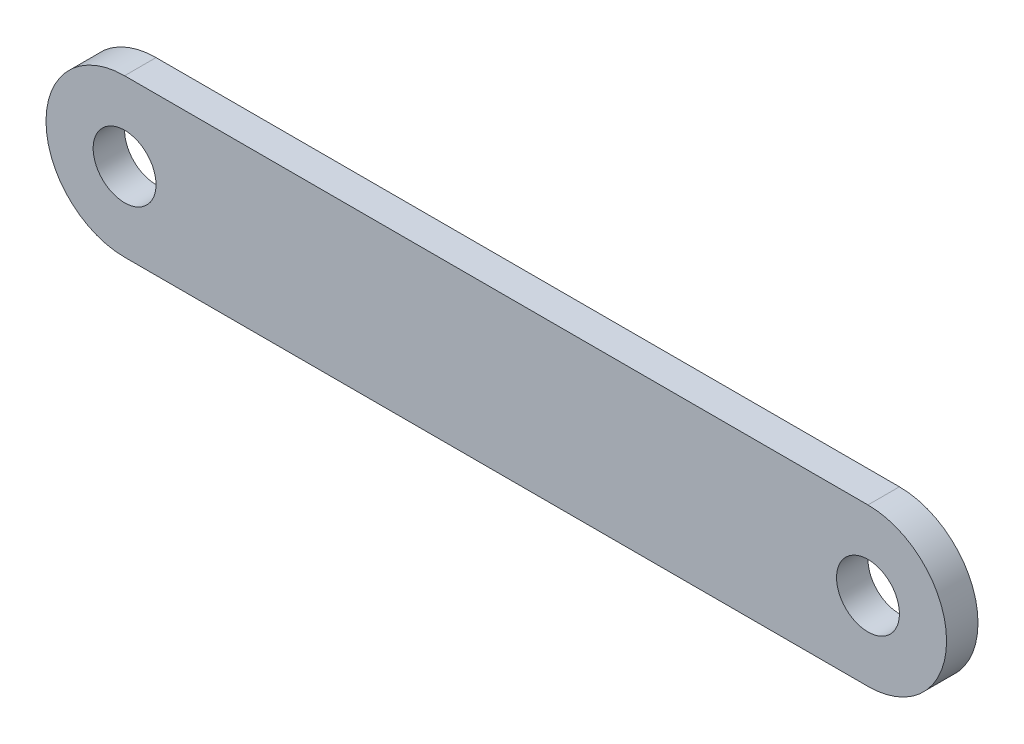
from build123d import *

# Parameters (mm, degrees)
BOSS_EXTRUDE1_DEPTH  = 5
M8_CLEARANCE_HOLE1_D = 10


with BuildPart() as part:
    # Sketch1 → Boss-Extrude1 (new body)
    with BuildSketch(Plane.XY):
        with BuildLine():
            Line((-59.120369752, 12.5), (59.120369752, 12.5))
            ThreePointArc((59.120369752, 12.5), (71.620369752, 0), (59.120369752, -12.5))
            Line((59.120369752, -12.5), (-59.120369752, -12.5))
            ThreePointArc((-59.120369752, -12.5), (-71.620369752, 0), (-59.120369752, 12.5))
        make_face()
    extrude(amount=BOSS_EXTRUDE1_DEPTH)

    # M8 Clearance Hole1 (through all)
    with Locations(Plane.XY.offset(5)):
        with Locations((-59.120369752, 0), (59.120369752, 0)):
            Hole(M8_CLEARANCE_HOLE1_D / 2)


solid = part.part
